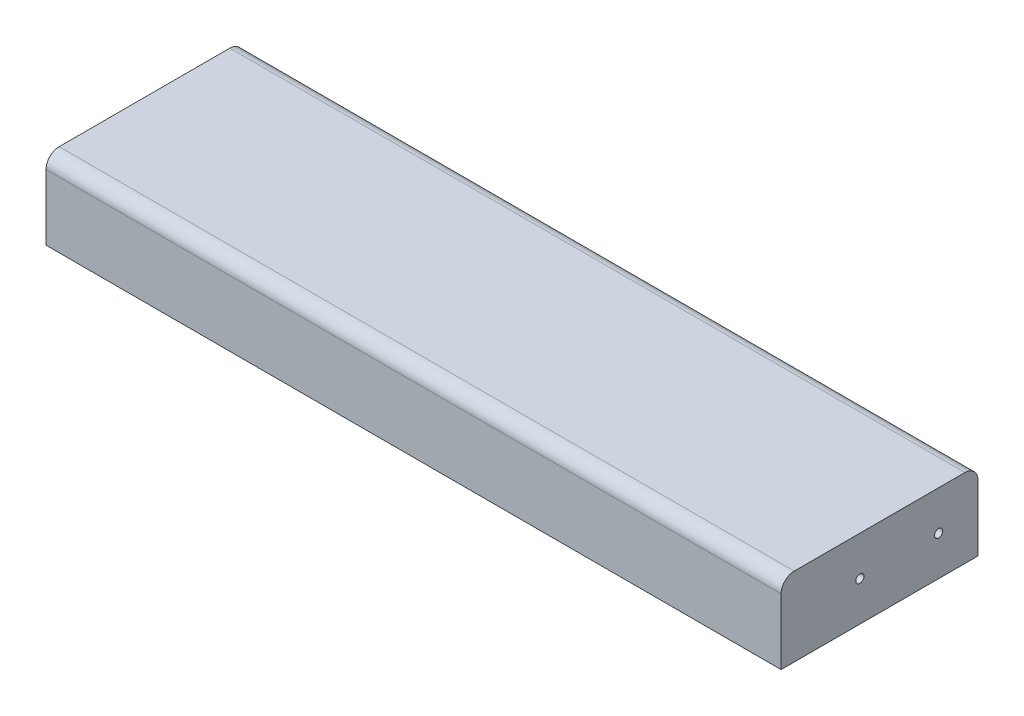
ISO-10303-21;
HEADER;
FILE_DESCRIPTION(('STEP AP214'),'2;1');
FILE_NAME('part.step','',(''),(''),'','','');
FILE_SCHEMA(('AUTOMOTIVE_DESIGN { 1 0 10303 214 1 1 1 1 }'));
ENDSEC;
DATA;
#1=APPLICATION_CONTEXT('core data for automotive mechanical design processes');
#2=APPLICATION_PROTOCOL_DEFINITION('international standard','automotive_design',2000,#1);
#3=PRODUCT_CONTEXT('',#1,'mechanical');
#4=PRODUCT('Part','Part','',(#3));
#5=PRODUCT_RELATED_PRODUCT_CATEGORY('part','',(#4));
#6=PRODUCT_DEFINITION_FORMATION('','',#4);
#7=PRODUCT_DEFINITION_CONTEXT('part definition',#1,'design');
#8=PRODUCT_DEFINITION('design','',#6,#7);
#9=PRODUCT_DEFINITION_SHAPE('','',#8);
#10=(LENGTH_UNIT() NAMED_UNIT(*) SI_UNIT(.MILLI.,.METRE.));
#11=(NAMED_UNIT(*) PLANE_ANGLE_UNIT() SI_UNIT($,.RADIAN.));
#12=(NAMED_UNIT(*) SI_UNIT($,.STERADIAN.) SOLID_ANGLE_UNIT());
#13=UNCERTAINTY_MEASURE_WITH_UNIT(LENGTH_MEASURE(1.E-05),#10,'distance_accuracy_value','');
#14=(GEOMETRIC_REPRESENTATION_CONTEXT(3) GLOBAL_UNCERTAINTY_ASSIGNED_CONTEXT((#13)) GLOBAL_UNIT_ASSIGNED_CONTEXT((#10,
#11,#12)) REPRESENTATION_CONTEXT('',''));
#15=CARTESIAN_POINT('',(0.,0.,0.));
#16=DIRECTION('',(0.,0.,1.));
#17=DIRECTION('',(1.,0.,0.));
#18=AXIS2_PLACEMENT_3D('',#15,#16,#17);
#19=CARTESIAN_POINT('',(280.,0.,37.5));
#20=DIRECTION('',(0.,1.,0.));
#21=DIRECTION('',(0.,0.,1.));
#22=AXIS2_PLACEMENT_3D('',#19,#20,#21);
#23=PLANE('',#22);
#24=DIRECTION('',(0.,0.,-1.));
#25=VECTOR('',#24,1.);
#26=CARTESIAN_POINT('',(0.,0.,37.5));
#27=LINE('',#26,#25);
#28=CARTESIAN_POINT('',(0.,0.,37.5));
#29=VERTEX_POINT('',#28);
#30=CARTESIAN_POINT('',(0.,0.,-37.5));
#31=VERTEX_POINT('',#30);
#32=EDGE_CURVE('E137',#29,#31,#27,.T.);
#33=ORIENTED_EDGE('',*,*,#32,.T.);
#34=DIRECTION('',(-1.,0.,0.));
#35=VECTOR('',#34,1.);
#36=CARTESIAN_POINT('',(280.,0.,-37.5));
#37=LINE('',#36,#35);
#38=CARTESIAN_POINT('',(280.,0.,-37.5));
#39=VERTEX_POINT('',#38);
#40=EDGE_CURVE('E122',#39,#31,#37,.T.);
#41=ORIENTED_EDGE('',*,*,#40,.F.);
#42=DIRECTION('',(0.,0.,-1.));
#43=VECTOR('',#42,1.);
#44=CARTESIAN_POINT('',(280.,0.,37.5));
#45=LINE('',#44,#43);
#46=CARTESIAN_POINT('',(280.,0.,37.5));
#47=VERTEX_POINT('',#46);
#48=EDGE_CURVE('E110',#47,#39,#45,.T.);
#49=ORIENTED_EDGE('',*,*,#48,.F.);
#50=DIRECTION('',(-1.,0.,0.));
#51=VECTOR('',#50,1.);
#52=CARTESIAN_POINT('',(280.,0.,37.5));
#53=LINE('',#52,#51);
#54=EDGE_CURVE('E41',#47,#29,#53,.T.);
#55=ORIENTED_EDGE('',*,*,#54,.T.);
#56=EDGE_LOOP('',(#33,#41,#49,#55));
#57=FACE_BOUND('',#56,.T.);
#58=DIRECTION('',(0.,0.,-1.));
#59=VECTOR('',#58,1.);
#60=CARTESIAN_POINT('',(2.,0.,37.5));
#61=LINE('',#60,#59);
#62=CARTESIAN_POINT('',(2.,0.,35.5));
#63=VERTEX_POINT('',#62);
#64=CARTESIAN_POINT('',(2.,0.,-35.5));
#65=VERTEX_POINT('',#64);
#66=EDGE_CURVE('E178',#63,#65,#61,.T.);
#67=ORIENTED_EDGE('',*,*,#66,.F.);
#68=DIRECTION('',(-1.,0.,0.));
#69=VECTOR('',#68,1.);
#70=CARTESIAN_POINT('',(280.,0.,35.5));
#71=LINE('',#70,#69);
#72=CARTESIAN_POINT('',(278.,0.,35.5));
#73=VERTEX_POINT('',#72);
#74=EDGE_CURVE('E176',#73,#63,#71,.T.);
#75=ORIENTED_EDGE('',*,*,#74,.F.);
#76=DIRECTION('',(0.,0.,-1.));
#77=VECTOR('',#76,1.);
#78=CARTESIAN_POINT('',(278.,0.,37.5));
#79=LINE('',#78,#77);
#80=CARTESIAN_POINT('',(278.,0.,-35.5));
#81=VERTEX_POINT('',#80);
#82=EDGE_CURVE('E48',#73,#81,#79,.T.);
#83=ORIENTED_EDGE('',*,*,#82,.T.);
#84=DIRECTION('',(-1.,0.,0.));
#85=VECTOR('',#84,1.);
#86=CARTESIAN_POINT('',(280.,0.,-35.5));
#87=LINE('',#86,#85);
#88=EDGE_CURVE('E173',#81,#65,#87,.T.);
#89=ORIENTED_EDGE('',*,*,#88,.T.);
#90=EDGE_LOOP('',(#67,#75,#83,#89));
#91=FACE_BOUND('',#90,.T.);
#92=ADVANCED_FACE('F33',(#57,#91),#23,.F.);
#93=CARTESIAN_POINT('',(280.,25.,32.5));
#94=DIRECTION('',(1.,0.,0.));
#95=DIRECTION('',(0.,0.,-1.));
#96=AXIS2_PLACEMENT_3D('',#93,#94,#95);
#97=PLANE('',#96);
#98=CARTESIAN_POINT('',(280.,15.,7.49999999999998));
#99=DIRECTION('',(1.,0.,0.));
#100=DIRECTION('',(0.,0.,-1.));
#101=AXIS2_PLACEMENT_3D('',#98,#99,#100);
#102=CIRCLE('',#101,1.55);
#103=CARTESIAN_POINT('',(280.,15.,5.94999999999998));
#104=VERTEX_POINT('',#103);
#105=EDGE_CURVE('E135',#104,#104,#102,.T.);
#106=ORIENTED_EDGE('',*,*,#105,.F.);
#107=EDGE_LOOP('',(#106));
#108=FACE_BOUND('',#107,.T.);
#109=CARTESIAN_POINT('',(280.,25.,32.5));
#110=DIRECTION('',(1.,0.,0.));
#111=DIRECTION('',(0.,0.,-1.));
#112=AXIS2_PLACEMENT_3D('',#109,#110,#111);
#113=CIRCLE('',#112,5.);
#114=CARTESIAN_POINT('',(280.,30.,32.5));
#115=VERTEX_POINT('',#114);
#116=CARTESIAN_POINT('',(280.,25.,37.5));
#117=VERTEX_POINT('',#116);
#118=EDGE_CURVE('E143',#115,#117,#113,.T.);
#119=ORIENTED_EDGE('',*,*,#118,.T.);
#120=DIRECTION('',(0.,-1.,0.));
#121=VECTOR('',#120,1.);
#122=CARTESIAN_POINT('',(280.,25.,37.5));
#123=LINE('',#122,#121);
#124=EDGE_CURVE('E92',#117,#47,#123,.T.);
#125=ORIENTED_EDGE('',*,*,#124,.T.);
#126=ORIENTED_EDGE('',*,*,#48,.T.);
#127=DIRECTION('',(0.,1.,0.));
#128=VECTOR('',#127,1.);
#129=CARTESIAN_POINT('',(280.,25.,-37.5));
#130=LINE('',#129,#128);
#131=CARTESIAN_POINT('',(280.,25.,-37.5));
#132=VERTEX_POINT('',#131);
#133=EDGE_CURVE('E102',#39,#132,#130,.T.);
#134=ORIENTED_EDGE('',*,*,#133,.T.);
#135=CARTESIAN_POINT('',(280.,25.,-32.5));
#136=DIRECTION('',(1.,0.,0.));
#137=DIRECTION('',(0.,0.,1.));
#138=AXIS2_PLACEMENT_3D('',#135,#136,#137);
#139=CIRCLE('',#138,5.);
#140=CARTESIAN_POINT('',(280.,30.,-32.5));
#141=VERTEX_POINT('',#140);
#142=EDGE_CURVE('E107',#132,#141,#139,.T.);
#143=ORIENTED_EDGE('',*,*,#142,.T.);
#144=DIRECTION('',(0.,0.,1.));
#145=VECTOR('',#144,1.);
#146=CARTESIAN_POINT('',(280.,30.,32.5));
#147=LINE('',#146,#145);
#148=EDGE_CURVE('E57',#141,#115,#147,.T.);
#149=ORIENTED_EDGE('',*,*,#148,.T.);
#150=EDGE_LOOP('',(#119,#125,#126,#134,#143,#149));
#151=FACE_BOUND('',#150,.T.);
#152=CARTESIAN_POINT('',(280.,15.,-22.5));
#153=DIRECTION('',(1.,0.,0.));
#154=DIRECTION('',(0.,0.,-1.));
#155=AXIS2_PLACEMENT_3D('',#152,#153,#154);
#156=CIRCLE('',#155,1.55);
#157=CARTESIAN_POINT('',(280.,15.,-24.05));
#158=VERTEX_POINT('',#157);
#159=EDGE_CURVE('E164',#158,#158,#156,.T.);
#160=ORIENTED_EDGE('',*,*,#159,.F.);
#161=EDGE_LOOP('',(#160));
#162=FACE_BOUND('',#161,.T.);
#163=ADVANCED_FACE('F104',(#108,#151,#162),#97,.T.);
#164=CARTESIAN_POINT('',(0.,25.,32.5));
#165=DIRECTION('',(1.,0.,0.));
#166=DIRECTION('',(0.,0.,-1.));
#167=AXIS2_PLACEMENT_3D('',#164,#165,#166);
#168=PLANE('',#167);
#169=CARTESIAN_POINT('',(0.,25.,32.5));
#170=DIRECTION('',(1.,0.,0.));
#171=DIRECTION('',(0.,0.,-1.));
#172=AXIS2_PLACEMENT_3D('',#169,#170,#171);
#173=CIRCLE('',#172,5.);
#174=CARTESIAN_POINT('',(0.,30.,32.5));
#175=VERTEX_POINT('',#174);
#176=CARTESIAN_POINT('',(0.,25.,37.5));
#177=VERTEX_POINT('',#176);
#178=EDGE_CURVE('E131',#175,#177,#173,.T.);
#179=ORIENTED_EDGE('',*,*,#178,.F.);
#180=DIRECTION('',(0.,0.,1.));
#181=VECTOR('',#180,1.);
#182=CARTESIAN_POINT('',(0.,30.,32.5));
#183=LINE('',#182,#181);
#184=CARTESIAN_POINT('',(0.,30.,-32.5));
#185=VERTEX_POINT('',#184);
#186=EDGE_CURVE('E84',#185,#175,#183,.T.);
#187=ORIENTED_EDGE('',*,*,#186,.F.);
#188=CARTESIAN_POINT('',(0.,25.,-32.5));
#189=DIRECTION('',(1.,0.,0.));
#190=DIRECTION('',(0.,0.,1.));
#191=AXIS2_PLACEMENT_3D('',#188,#189,#190);
#192=CIRCLE('',#191,5.);
#193=CARTESIAN_POINT('',(0.,25.,-37.5));
#194=VERTEX_POINT('',#193);
#195=EDGE_CURVE('E140',#194,#185,#192,.T.);
#196=ORIENTED_EDGE('',*,*,#195,.F.);
#197=DIRECTION('',(0.,1.,0.));
#198=VECTOR('',#197,1.);
#199=CARTESIAN_POINT('',(0.,25.,-37.5));
#200=LINE('',#199,#198);
#201=EDGE_CURVE('E119',#31,#194,#200,.T.);
#202=ORIENTED_EDGE('',*,*,#201,.F.);
#203=ORIENTED_EDGE('',*,*,#32,.F.);
#204=DIRECTION('',(0.,-1.,0.));
#205=VECTOR('',#204,1.);
#206=CARTESIAN_POINT('',(0.,25.,37.5));
#207=LINE('',#206,#205);
#208=EDGE_CURVE('E134',#177,#29,#207,.T.);
#209=ORIENTED_EDGE('',*,*,#208,.F.);
#210=EDGE_LOOP('',(#179,#187,#196,#202,#203,#209));
#211=FACE_BOUND('',#210,.T.);
#212=CARTESIAN_POINT('',(0.,15.,7.49999999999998));
#213=DIRECTION('',(1.,0.,0.));
#214=DIRECTION('',(0.,0.,-1.));
#215=AXIS2_PLACEMENT_3D('',#212,#213,#214);
#216=CIRCLE('',#215,1.55);
#217=CARTESIAN_POINT('',(0.,15.,5.94999999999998));
#218=VERTEX_POINT('',#217);
#219=EDGE_CURVE('E161',#218,#218,#216,.T.);
#220=ORIENTED_EDGE('',*,*,#219,.T.);
#221=EDGE_LOOP('',(#220));
#222=FACE_BOUND('',#221,.T.);
#223=CARTESIAN_POINT('',(0.,15.,-22.5));
#224=DIRECTION('',(1.,0.,0.));
#225=DIRECTION('',(0.,0.,-1.));
#226=AXIS2_PLACEMENT_3D('',#223,#224,#225);
#227=CIRCLE('',#226,1.55);
#228=CARTESIAN_POINT('',(0.,15.,-24.05));
#229=VERTEX_POINT('',#228);
#230=EDGE_CURVE('E167',#229,#229,#227,.T.);
#231=ORIENTED_EDGE('',*,*,#230,.T.);
#232=EDGE_LOOP('',(#231));
#233=FACE_BOUND('',#232,.T.);
#234=ADVANCED_FACE('F152',(#211,#222,#233),#168,.F.);
#235=CARTESIAN_POINT('',(280.,25.,32.5));
#236=DIRECTION('',(-1.,0.,0.));
#237=DIRECTION('',(0.,0.,1.));
#238=AXIS2_PLACEMENT_3D('',#235,#236,#237);
#239=CYLINDRICAL_SURFACE('',#238,5.);
#240=ORIENTED_EDGE('',*,*,#178,.T.);
#241=DIRECTION('',(-1.,0.,0.));
#242=VECTOR('',#241,1.);
#243=CARTESIAN_POINT('',(280.,25.,37.5));
#244=LINE('',#243,#242);
#245=EDGE_CURVE('E11',#117,#177,#244,.T.);
#246=ORIENTED_EDGE('',*,*,#245,.F.);
#247=ORIENTED_EDGE('',*,*,#118,.F.);
#248=DIRECTION('',(-1.,0.,0.));
#249=VECTOR('',#248,1.);
#250=CARTESIAN_POINT('',(280.,30.,32.5));
#251=LINE('',#250,#249);
#252=EDGE_CURVE('E127',#115,#175,#251,.T.);
#253=ORIENTED_EDGE('',*,*,#252,.T.);
#254=EDGE_LOOP('',(#240,#246,#247,#253));
#255=FACE_BOUND('',#254,.T.);
#256=ADVANCED_FACE('F35',(#255),#239,.T.);
#257=CARTESIAN_POINT('',(280.,25.,37.5));
#258=DIRECTION('',(0.,0.,-1.));
#259=DIRECTION('',(-1.,0.,0.));
#260=AXIS2_PLACEMENT_3D('',#257,#258,#259);
#261=PLANE('',#260);
#262=ORIENTED_EDGE('',*,*,#208,.T.);
#263=ORIENTED_EDGE('',*,*,#54,.F.);
#264=ORIENTED_EDGE('',*,*,#124,.F.);
#265=ORIENTED_EDGE('',*,*,#245,.T.);
#266=EDGE_LOOP('',(#262,#263,#264,#265));
#267=FACE_BOUND('',#266,.T.);
#268=ADVANCED_FACE('F270',(#267),#261,.F.);
#269=CARTESIAN_POINT('',(280.,25.,-37.5));
#270=DIRECTION('',(0.,0.,1.));
#271=DIRECTION('',(1.,0.,0.));
#272=AXIS2_PLACEMENT_3D('',#269,#270,#271);
#273=PLANE('',#272);
#274=ORIENTED_EDGE('',*,*,#201,.T.);
#275=DIRECTION('',(-1.,0.,0.));
#276=VECTOR('',#275,1.);
#277=CARTESIAN_POINT('',(280.,25.,-37.5));
#278=LINE('',#277,#276);
#279=EDGE_CURVE('E116',#132,#194,#278,.T.);
#280=ORIENTED_EDGE('',*,*,#279,.F.);
#281=ORIENTED_EDGE('',*,*,#133,.F.);
#282=ORIENTED_EDGE('',*,*,#40,.T.);
#283=EDGE_LOOP('',(#274,#280,#281,#282));
#284=FACE_BOUND('',#283,.T.);
#285=ADVANCED_FACE('F117',(#284),#273,.F.);
#286=CARTESIAN_POINT('',(280.,25.,-32.5));
#287=DIRECTION('',(-1.,0.,0.));
#288=DIRECTION('',(0.,0.,1.));
#289=AXIS2_PLACEMENT_3D('',#286,#287,#288);
#290=CYLINDRICAL_SURFACE('',#289,5.);
#291=ORIENTED_EDGE('',*,*,#195,.T.);
#292=DIRECTION('',(-1.,0.,0.));
#293=VECTOR('',#292,1.);
#294=CARTESIAN_POINT('',(280.,30.,-32.5));
#295=LINE('',#294,#293);
#296=EDGE_CURVE('E123',#141,#185,#295,.T.);
#297=ORIENTED_EDGE('',*,*,#296,.F.);
#298=ORIENTED_EDGE('',*,*,#142,.F.);
#299=ORIENTED_EDGE('',*,*,#279,.T.);
#300=EDGE_LOOP('',(#291,#297,#298,#299));
#301=FACE_BOUND('',#300,.T.);
#302=ADVANCED_FACE('F125',(#301),#290,.T.);
#303=CARTESIAN_POINT('',(280.,30.,32.5));
#304=DIRECTION('',(0.,-1.,0.));
#305=DIRECTION('',(0.,0.,-1.));
#306=AXIS2_PLACEMENT_3D('',#303,#304,#305);
#307=PLANE('',#306);
#308=ORIENTED_EDGE('',*,*,#186,.T.);
#309=ORIENTED_EDGE('',*,*,#252,.F.);
#310=ORIENTED_EDGE('',*,*,#148,.F.);
#311=ORIENTED_EDGE('',*,*,#296,.T.);
#312=EDGE_LOOP('',(#308,#309,#310,#311));
#313=FACE_BOUND('',#312,.T.);
#314=ADVANCED_FACE('F154',(#313),#307,.F.);
#315=CARTESIAN_POINT('',(280.,15.,7.49999999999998));
#316=DIRECTION('',(-1.,0.,0.));
#317=DIRECTION('',(0.,0.,1.));
#318=AXIS2_PLACEMENT_3D('',#315,#316,#317);
#319=CYLINDRICAL_SURFACE('',#318,1.55);
#320=ORIENTED_EDGE('',*,*,#105,.T.);
#321=EDGE_LOOP('',(#320));
#322=FACE_BOUND('',#321,.T.);
#323=ORIENTED_EDGE('',*,*,#219,.F.);
#324=EDGE_LOOP('',(#323));
#325=FACE_BOUND('',#324,.T.);
#326=ADVANCED_FACE('F285',(#322,#325),#319,.F.);
#327=CARTESIAN_POINT('',(280.,15.,-22.5));
#328=DIRECTION('',(-1.,0.,0.));
#329=DIRECTION('',(0.,0.,1.));
#330=AXIS2_PLACEMENT_3D('',#327,#328,#329);
#331=CYLINDRICAL_SURFACE('',#330,1.55);
#332=ORIENTED_EDGE('',*,*,#159,.T.);
#333=EDGE_LOOP('',(#332));
#334=FACE_BOUND('',#333,.T.);
#335=ORIENTED_EDGE('',*,*,#230,.F.);
#336=EDGE_LOOP('',(#335));
#337=FACE_BOUND('',#336,.T.);
#338=ADVANCED_FACE('F301',(#334,#337),#331,.F.);
#339=CARTESIAN_POINT('',(278.,25.,32.5));
#340=DIRECTION('',(1.,0.,0.));
#341=DIRECTION('',(0.,0.,-1.));
#342=AXIS2_PLACEMENT_3D('',#339,#340,#341);
#343=PLANE('',#342);
#344=CARTESIAN_POINT('',(278.,15.,7.49999999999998));
#345=DIRECTION('',(1.,0.,0.));
#346=DIRECTION('',(0.,0.,-1.));
#347=AXIS2_PLACEMENT_3D('',#344,#345,#346);
#348=CIRCLE('',#347,3.55);
#349=CARTESIAN_POINT('',(278.,15.,3.94999999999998));
#350=VERTEX_POINT('',#349);
#351=EDGE_CURVE('E201',#350,#350,#348,.T.);
#352=ORIENTED_EDGE('',*,*,#351,.T.);
#353=EDGE_LOOP('',(#352));
#354=FACE_BOUND('',#353,.T.);
#355=CARTESIAN_POINT('',(278.,25.,32.5));
#356=DIRECTION('',(1.,0.,0.));
#357=DIRECTION('',(0.,0.,-1.));
#358=AXIS2_PLACEMENT_3D('',#355,#356,#357);
#359=CIRCLE('',#358,3.);
#360=CARTESIAN_POINT('',(278.,28.,32.5));
#361=VERTEX_POINT('',#360);
#362=CARTESIAN_POINT('',(278.,25.,35.5));
#363=VERTEX_POINT('',#362);
#364=EDGE_CURVE('E213',#361,#363,#359,.T.);
#365=ORIENTED_EDGE('',*,*,#364,.F.);
#366=DIRECTION('',(0.,0.,1.));
#367=VECTOR('',#366,1.);
#368=CARTESIAN_POINT('',(278.,28.,32.5));
#369=LINE('',#368,#367);
#370=CARTESIAN_POINT('',(278.,28.,-32.5));
#371=VERTEX_POINT('',#370);
#372=EDGE_CURVE('E216',#371,#361,#369,.T.);
#373=ORIENTED_EDGE('',*,*,#372,.F.);
#374=CARTESIAN_POINT('',(278.,25.,-32.5));
#375=DIRECTION('',(1.,0.,0.));
#376=DIRECTION('',(0.,0.,-1.));
#377=AXIS2_PLACEMENT_3D('',#374,#375,#376);
#378=CIRCLE('',#377,3.);
#379=CARTESIAN_POINT('',(278.,25.,-35.5));
#380=VERTEX_POINT('',#379);
#381=EDGE_CURVE('E225',#380,#371,#378,.T.);
#382=ORIENTED_EDGE('',*,*,#381,.F.);
#383=DIRECTION('',(0.,1.,0.));
#384=VECTOR('',#383,1.);
#385=CARTESIAN_POINT('',(278.,25.,-35.5));
#386=LINE('',#385,#384);
#387=EDGE_CURVE('E186',#81,#380,#386,.T.);
#388=ORIENTED_EDGE('',*,*,#387,.F.);
#389=ORIENTED_EDGE('',*,*,#82,.F.);
#390=DIRECTION('',(0.,-1.,0.));
#391=VECTOR('',#390,1.);
#392=CARTESIAN_POINT('',(278.,25.,35.5));
#393=LINE('',#392,#391);
#394=EDGE_CURVE('E187',#363,#73,#393,.T.);
#395=ORIENTED_EDGE('',*,*,#394,.F.);
#396=EDGE_LOOP('',(#365,#373,#382,#388,#389,#395));
#397=FACE_BOUND('',#396,.T.);
#398=CARTESIAN_POINT('',(278.,15.,-22.5));
#399=DIRECTION('',(1.,0.,0.));
#400=DIRECTION('',(0.,0.,-1.));
#401=AXIS2_PLACEMENT_3D('',#398,#399,#400);
#402=CIRCLE('',#401,3.55);
#403=CARTESIAN_POINT('',(278.,15.,-26.05));
#404=VERTEX_POINT('',#403);
#405=EDGE_CURVE('E197',#404,#404,#402,.T.);
#406=ORIENTED_EDGE('',*,*,#405,.T.);
#407=EDGE_LOOP('',(#406));
#408=FACE_BOUND('',#407,.T.);
#409=ADVANCED_FACE('F236',(#354,#397,#408),#343,.F.);
#410=CARTESIAN_POINT('',(2.,25.,32.5));
#411=DIRECTION('',(1.,0.,0.));
#412=DIRECTION('',(0.,0.,-1.));
#413=AXIS2_PLACEMENT_3D('',#410,#411,#412);
#414=PLANE('',#413);
#415=CARTESIAN_POINT('',(2.,25.,32.5));
#416=DIRECTION('',(1.,0.,0.));
#417=DIRECTION('',(0.,0.,-1.));
#418=AXIS2_PLACEMENT_3D('',#415,#416,#417);
#419=CIRCLE('',#418,3.);
#420=CARTESIAN_POINT('',(2.,28.,32.5));
#421=VERTEX_POINT('',#420);
#422=CARTESIAN_POINT('',(2.,25.,35.5));
#423=VERTEX_POINT('',#422);
#424=EDGE_CURVE('E204',#421,#423,#419,.T.);
#425=ORIENTED_EDGE('',*,*,#424,.T.);
#426=DIRECTION('',(0.,-1.,0.));
#427=VECTOR('',#426,1.);
#428=CARTESIAN_POINT('',(2.,25.,35.5));
#429=LINE('',#428,#427);
#430=EDGE_CURVE('E182',#423,#63,#429,.T.);
#431=ORIENTED_EDGE('',*,*,#430,.T.);
#432=ORIENTED_EDGE('',*,*,#66,.T.);
#433=DIRECTION('',(0.,1.,0.));
#434=VECTOR('',#433,1.);
#435=CARTESIAN_POINT('',(2.,25.,-35.5));
#436=LINE('',#435,#434);
#437=CARTESIAN_POINT('',(2.,25.,-35.5));
#438=VERTEX_POINT('',#437);
#439=EDGE_CURVE('E181',#65,#438,#436,.T.);
#440=ORIENTED_EDGE('',*,*,#439,.T.);
#441=CARTESIAN_POINT('',(2.,25.,-32.5));
#442=DIRECTION('',(1.,0.,0.));
#443=DIRECTION('',(0.,0.,-1.));
#444=AXIS2_PLACEMENT_3D('',#441,#442,#443);
#445=CIRCLE('',#444,3.);
#446=CARTESIAN_POINT('',(2.,28.,-32.5));
#447=VERTEX_POINT('',#446);
#448=EDGE_CURVE('E207',#438,#447,#445,.T.);
#449=ORIENTED_EDGE('',*,*,#448,.T.);
#450=DIRECTION('',(0.,0.,1.));
#451=VECTOR('',#450,1.);
#452=CARTESIAN_POINT('',(2.,28.,32.5));
#453=LINE('',#452,#451);
#454=EDGE_CURVE('E210',#447,#421,#453,.T.);
#455=ORIENTED_EDGE('',*,*,#454,.T.);
#456=EDGE_LOOP('',(#425,#431,#432,#440,#449,#455));
#457=FACE_BOUND('',#456,.T.);
#458=CARTESIAN_POINT('',(2.,15.,7.49999999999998));
#459=DIRECTION('',(1.,0.,0.));
#460=DIRECTION('',(0.,0.,-1.));
#461=AXIS2_PLACEMENT_3D('',#458,#459,#460);
#462=CIRCLE('',#461,3.55);
#463=CARTESIAN_POINT('',(2.,15.,3.94999999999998));
#464=VERTEX_POINT('',#463);
#465=EDGE_CURVE('E198',#464,#464,#462,.T.);
#466=ORIENTED_EDGE('',*,*,#465,.F.);
#467=EDGE_LOOP('',(#466));
#468=FACE_BOUND('',#467,.T.);
#469=CARTESIAN_POINT('',(2.,15.,-22.5));
#470=DIRECTION('',(1.,0.,0.));
#471=DIRECTION('',(0.,0.,-1.));
#472=AXIS2_PLACEMENT_3D('',#469,#470,#471);
#473=CIRCLE('',#472,3.55);
#474=CARTESIAN_POINT('',(2.,15.,-26.05));
#475=VERTEX_POINT('',#474);
#476=EDGE_CURVE('E194',#475,#475,#473,.T.);
#477=ORIENTED_EDGE('',*,*,#476,.F.);
#478=EDGE_LOOP('',(#477));
#479=FACE_BOUND('',#478,.T.);
#480=ADVANCED_FACE('F246',(#457,#468,#479),#414,.T.);
#481=CARTESIAN_POINT('',(280.,25.,32.5));
#482=DIRECTION('',(-1.,0.,0.));
#483=DIRECTION('',(0.,0.,1.));
#484=AXIS2_PLACEMENT_3D('',#481,#482,#483);
#485=CYLINDRICAL_SURFACE('',#484,3.);
#486=ORIENTED_EDGE('',*,*,#424,.F.);
#487=DIRECTION('',(-1.,0.,0.));
#488=VECTOR('',#487,1.);
#489=CARTESIAN_POINT('',(280.,28.,32.5));
#490=LINE('',#489,#488);
#491=EDGE_CURVE('E191',#361,#421,#490,.T.);
#492=ORIENTED_EDGE('',*,*,#491,.F.);
#493=ORIENTED_EDGE('',*,*,#364,.T.);
#494=DIRECTION('',(-1.,0.,0.));
#495=VECTOR('',#494,1.);
#496=CARTESIAN_POINT('',(280.,25.,35.5));
#497=LINE('',#496,#495);
#498=EDGE_CURVE('E170',#363,#423,#497,.T.);
#499=ORIENTED_EDGE('',*,*,#498,.T.);
#500=EDGE_LOOP('',(#486,#492,#493,#499));
#501=FACE_BOUND('',#500,.T.);
#502=ADVANCED_FACE('F249',(#501),#485,.F.);
#503=CARTESIAN_POINT('',(280.,25.,35.5));
#504=DIRECTION('',(0.,0.,-1.));
#505=DIRECTION('',(-1.,0.,0.));
#506=AXIS2_PLACEMENT_3D('',#503,#504,#505);
#507=PLANE('',#506);
#508=ORIENTED_EDGE('',*,*,#430,.F.);
#509=ORIENTED_EDGE('',*,*,#498,.F.);
#510=ORIENTED_EDGE('',*,*,#394,.T.);
#511=ORIENTED_EDGE('',*,*,#74,.T.);
#512=EDGE_LOOP('',(#508,#509,#510,#511));
#513=FACE_BOUND('',#512,.T.);
#514=ADVANCED_FACE('F324',(#513),#507,.T.);
#515=CARTESIAN_POINT('',(280.,25.,-35.5));
#516=DIRECTION('',(0.,0.,1.));
#517=DIRECTION('',(1.,0.,0.));
#518=AXIS2_PLACEMENT_3D('',#515,#516,#517);
#519=PLANE('',#518);
#520=ORIENTED_EDGE('',*,*,#439,.F.);
#521=ORIENTED_EDGE('',*,*,#88,.F.);
#522=ORIENTED_EDGE('',*,*,#387,.T.);
#523=DIRECTION('',(-1.,0.,0.));
#524=VECTOR('',#523,1.);
#525=CARTESIAN_POINT('',(280.,25.,-35.5));
#526=LINE('',#525,#524);
#527=EDGE_CURVE('E177',#380,#438,#526,.T.);
#528=ORIENTED_EDGE('',*,*,#527,.T.);
#529=EDGE_LOOP('',(#520,#521,#522,#528));
#530=FACE_BOUND('',#529,.T.);
#531=ADVANCED_FACE('F332',(#530),#519,.T.);
#532=CARTESIAN_POINT('',(280.,25.,-32.5));
#533=DIRECTION('',(-1.,0.,0.));
#534=DIRECTION('',(0.,0.,1.));
#535=AXIS2_PLACEMENT_3D('',#532,#533,#534);
#536=CYLINDRICAL_SURFACE('',#535,3.);
#537=ORIENTED_EDGE('',*,*,#448,.F.);
#538=ORIENTED_EDGE('',*,*,#527,.F.);
#539=ORIENTED_EDGE('',*,*,#381,.T.);
#540=DIRECTION('',(1.,0.,0.));
#541=VECTOR('',#540,1.);
#542=CARTESIAN_POINT('',(280.,28.,-32.5));
#543=LINE('',#542,#541);
#544=EDGE_CURVE('E188',#371,#447,#543,.F.);
#545=ORIENTED_EDGE('',*,*,#544,.T.);
#546=EDGE_LOOP('',(#537,#538,#539,#545));
#547=FACE_BOUND('',#546,.T.);
#548=ADVANCED_FACE('F340',(#547),#536,.F.);
#549=CARTESIAN_POINT('',(280.,28.,32.5));
#550=DIRECTION('',(0.,-1.,0.));
#551=DIRECTION('',(0.,0.,-1.));
#552=AXIS2_PLACEMENT_3D('',#549,#550,#551);
#553=PLANE('',#552);
#554=ORIENTED_EDGE('',*,*,#454,.F.);
#555=ORIENTED_EDGE('',*,*,#544,.F.);
#556=ORIENTED_EDGE('',*,*,#372,.T.);
#557=ORIENTED_EDGE('',*,*,#491,.T.);
#558=EDGE_LOOP('',(#554,#555,#556,#557));
#559=FACE_BOUND('',#558,.T.);
#560=ADVANCED_FACE('F242',(#559),#553,.T.);
#561=CARTESIAN_POINT('',(280.,15.,7.49999999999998));
#562=DIRECTION('',(-1.,0.,0.));
#563=DIRECTION('',(0.,0.,1.));
#564=AXIS2_PLACEMENT_3D('',#561,#562,#563);
#565=CYLINDRICAL_SURFACE('',#564,3.55);
#566=ORIENTED_EDGE('',*,*,#351,.F.);
#567=EDGE_LOOP('',(#566));
#568=FACE_BOUND('',#567,.T.);
#569=ORIENTED_EDGE('',*,*,#465,.T.);
#570=EDGE_LOOP('',(#569));
#571=FACE_BOUND('',#570,.T.);
#572=ADVANCED_FACE('F238',(#568,#571),#565,.T.);
#573=CARTESIAN_POINT('',(280.,15.,-22.5));
#574=DIRECTION('',(-1.,0.,0.));
#575=DIRECTION('',(0.,0.,1.));
#576=AXIS2_PLACEMENT_3D('',#573,#574,#575);
#577=CYLINDRICAL_SURFACE('',#576,3.55);
#578=ORIENTED_EDGE('',*,*,#405,.F.);
#579=EDGE_LOOP('',(#578));
#580=FACE_BOUND('',#579,.T.);
#581=ORIENTED_EDGE('',*,*,#476,.T.);
#582=EDGE_LOOP('',(#581));
#583=FACE_BOUND('',#582,.T.);
#584=ADVANCED_FACE('F241',(#580,#583),#577,.T.);
#585=CLOSED_SHELL('',(#92,#163,#234,#256,#268,#285,#302,#314,#326,#338,#409,#480,#502,#514,#531,
#548,#560,#572,#584));
#586=MANIFOLD_SOLID_BREP('B2',#585);
#587=ADVANCED_BREP_SHAPE_REPRESENTATION('',(#18,#586),#14);
#588=SHAPE_DEFINITION_REPRESENTATION(#9,#587);
ENDSEC;
END-ISO-10303-21;
